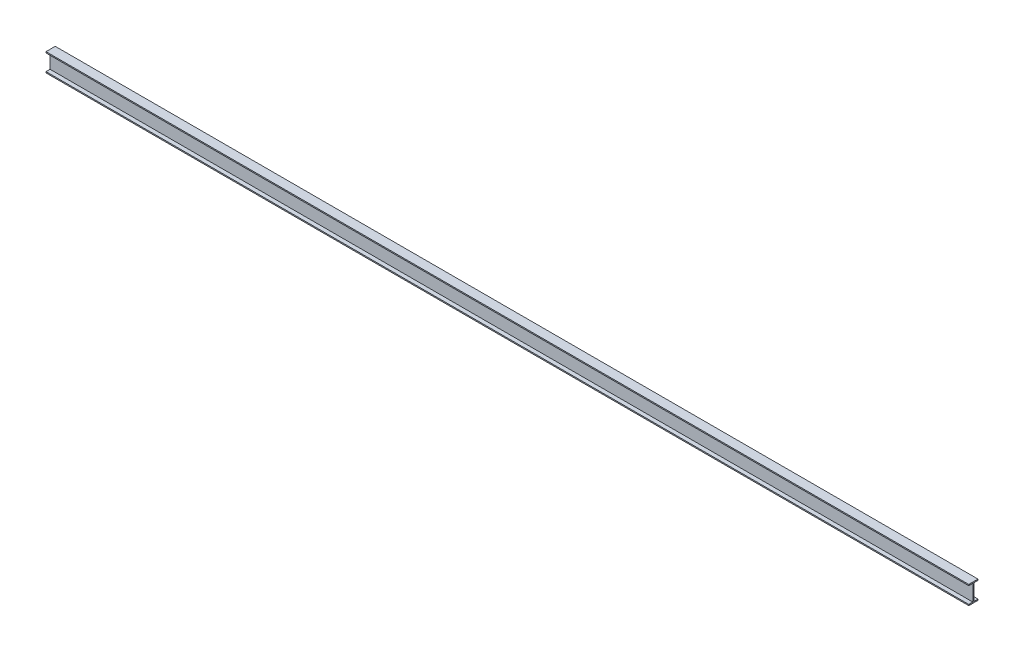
ISO-10303-21;
HEADER;
FILE_DESCRIPTION(('STEP AP214'),'2;1');
FILE_NAME('part.step','',(''),(''),'','','');
FILE_SCHEMA(('AUTOMOTIVE_DESIGN { 1 0 10303 214 1 1 1 1 }'));
ENDSEC;
DATA;
#1=APPLICATION_CONTEXT('core data for automotive mechanical design processes');
#2=APPLICATION_PROTOCOL_DEFINITION('international standard','automotive_design',2000,#1);
#3=PRODUCT_CONTEXT('',#1,'mechanical');
#4=PRODUCT('Part','Part','',(#3));
#5=PRODUCT_RELATED_PRODUCT_CATEGORY('part','',(#4));
#6=PRODUCT_DEFINITION_FORMATION('','',#4);
#7=PRODUCT_DEFINITION_CONTEXT('part definition',#1,'design');
#8=PRODUCT_DEFINITION('design','',#6,#7);
#9=PRODUCT_DEFINITION_SHAPE('','',#8);
#10=(LENGTH_UNIT() NAMED_UNIT(*) SI_UNIT(.MILLI.,.METRE.));
#11=(NAMED_UNIT(*) PLANE_ANGLE_UNIT() SI_UNIT($,.RADIAN.));
#12=(NAMED_UNIT(*) SI_UNIT($,.STERADIAN.) SOLID_ANGLE_UNIT());
#13=UNCERTAINTY_MEASURE_WITH_UNIT(LENGTH_MEASURE(1.E-05),#10,'distance_accuracy_value','');
#14=(GEOMETRIC_REPRESENTATION_CONTEXT(3) GLOBAL_UNCERTAINTY_ASSIGNED_CONTEXT((#13)) GLOBAL_UNIT_ASSIGNED_CONTEXT((#10,
#11,#12)) REPRESENTATION_CONTEXT('',''));
#15=CARTESIAN_POINT('',(0.,0.,0.));
#16=DIRECTION('',(0.,0.,1.));
#17=DIRECTION('',(1.,0.,0.));
#18=AXIS2_PLACEMENT_3D('',#15,#16,#17);
#19=CARTESIAN_POINT('',(8000.,10.,40.));
#20=DIRECTION('',(0.,0.,-1.));
#21=DIRECTION('',(0.,1.,0.));
#22=AXIS2_PLACEMENT_3D('',#19,#20,#21);
#23=PLANE('',#22);
#24=DIRECTION('',(0.,-1.,0.));
#25=VECTOR('',#24,1.);
#26=CARTESIAN_POINT('',(0.,10.,40.));
#27=LINE('',#26,#25);
#28=CARTESIAN_POINT('',(0.,10.,40.));
#29=VERTEX_POINT('',#28);
#30=CARTESIAN_POINT('',(0.,0.,40.));
#31=VERTEX_POINT('',#30);
#32=EDGE_CURVE('E151',#29,#31,#27,.T.);
#33=ORIENTED_EDGE('',*,*,#32,.T.);
#34=DIRECTION('',(-1.,0.,0.));
#35=VECTOR('',#34,1.);
#36=CARTESIAN_POINT('',(8000.,0.,40.));
#37=LINE('',#36,#35);
#38=CARTESIAN_POINT('',(8000.,0.,40.));
#39=VERTEX_POINT('',#38);
#40=EDGE_CURVE('E11',#39,#31,#37,.T.);
#41=ORIENTED_EDGE('',*,*,#40,.F.);
#42=DIRECTION('',(0.,-1.,0.));
#43=VECTOR('',#42,1.);
#44=CARTESIAN_POINT('',(8000.,10.,40.));
#45=LINE('',#44,#43);
#46=CARTESIAN_POINT('',(8000.,10.,40.));
#47=VERTEX_POINT('',#46);
#48=EDGE_CURVE('E173',#47,#39,#45,.T.);
#49=ORIENTED_EDGE('',*,*,#48,.F.);
#50=DIRECTION('',(-1.,0.,0.));
#51=VECTOR('',#50,1.);
#52=CARTESIAN_POINT('',(8000.,10.,40.));
#53=LINE('',#52,#51);
#54=EDGE_CURVE('E147',#47,#29,#53,.T.);
#55=ORIENTED_EDGE('',*,*,#54,.T.);
#56=EDGE_LOOP('',(#33,#41,#49,#55));
#57=FACE_BOUND('',#56,.T.);
#58=ADVANCED_FACE('F31',(#57),#23,.F.);
#59=CARTESIAN_POINT('',(8000.,0.,40.));
#60=DIRECTION('',(0.,1.,0.));
#61=DIRECTION('',(0.,0.,1.));
#62=AXIS2_PLACEMENT_3D('',#59,#60,#61);
#63=PLANE('',#62);
#64=DIRECTION('',(0.,0.,-1.));
#65=VECTOR('',#64,1.);
#66=CARTESIAN_POINT('',(0.,0.,40.));
#67=LINE('',#66,#65);
#68=CARTESIAN_POINT('',(0.,0.,-40.));
#69=VERTEX_POINT('',#68);
#70=EDGE_CURVE('E154',#31,#69,#67,.T.);
#71=ORIENTED_EDGE('',*,*,#70,.T.);
#72=DIRECTION('',(-1.,0.,0.));
#73=VECTOR('',#72,1.);
#74=CARTESIAN_POINT('',(8000.,0.,-40.));
#75=LINE('',#74,#73);
#76=CARTESIAN_POINT('',(8000.,0.,-40.));
#77=VERTEX_POINT('',#76);
#78=EDGE_CURVE('E39',#77,#69,#75,.T.);
#79=ORIENTED_EDGE('',*,*,#78,.F.);
#80=DIRECTION('',(0.,0.,-1.));
#81=VECTOR('',#80,1.);
#82=CARTESIAN_POINT('',(8000.,0.,40.));
#83=LINE('',#82,#81);
#84=EDGE_CURVE('E102',#39,#77,#83,.T.);
#85=ORIENTED_EDGE('',*,*,#84,.F.);
#86=ORIENTED_EDGE('',*,*,#40,.T.);
#87=EDGE_LOOP('',(#71,#79,#85,#86));
#88=FACE_BOUND('',#87,.T.);
#89=ADVANCED_FACE('F251',(#88),#63,.F.);
#90=CARTESIAN_POINT('',(8000.,0.,-40.));
#91=DIRECTION('',(0.,0.,1.));
#92=DIRECTION('',(0.,-1.,0.));
#93=AXIS2_PLACEMENT_3D('',#90,#91,#92);
#94=PLANE('',#93);
#95=DIRECTION('',(0.,1.,0.));
#96=VECTOR('',#95,1.);
#97=CARTESIAN_POINT('',(0.,0.,-40.));
#98=LINE('',#97,#96);
#99=CARTESIAN_POINT('',(0.,10.,-40.));
#100=VERTEX_POINT('',#99);
#101=EDGE_CURVE('E156',#69,#100,#98,.T.);
#102=ORIENTED_EDGE('',*,*,#101,.T.);
#103=DIRECTION('',(-1.,0.,0.));
#104=VECTOR('',#103,1.);
#105=CARTESIAN_POINT('',(8000.,10.,-40.));
#106=LINE('',#105,#104);
#107=CARTESIAN_POINT('',(8000.,10.,-40.));
#108=VERTEX_POINT('',#107);
#109=EDGE_CURVE('E192',#108,#100,#106,.T.);
#110=ORIENTED_EDGE('',*,*,#109,.F.);
#111=DIRECTION('',(0.,1.,0.));
#112=VECTOR('',#111,1.);
#113=CARTESIAN_POINT('',(8000.,0.,-40.));
#114=LINE('',#113,#112);
#115=EDGE_CURVE('E200',#77,#108,#114,.T.);
#116=ORIENTED_EDGE('',*,*,#115,.F.);
#117=ORIENTED_EDGE('',*,*,#78,.T.);
#118=EDGE_LOOP('',(#102,#110,#116,#117));
#119=FACE_BOUND('',#118,.T.);
#120=ADVANCED_FACE('F198',(#119),#94,.F.);
#121=CARTESIAN_POINT('',(8000.,10.,-40.));
#122=DIRECTION('',(0.,-1.,0.));
#123=DIRECTION('',(0.,0.,-1.));
#124=AXIS2_PLACEMENT_3D('',#121,#122,#123);
#125=PLANE('',#124);
#126=DIRECTION('',(0.,0.,1.));
#127=VECTOR('',#126,1.);
#128=CARTESIAN_POINT('',(0.,10.,-40.));
#129=LINE('',#128,#127);
#130=CARTESIAN_POINT('',(0.,10.,-5.));
#131=VERTEX_POINT('',#130);
#132=EDGE_CURVE('E158',#100,#131,#129,.T.);
#133=ORIENTED_EDGE('',*,*,#132,.T.);
#134=DIRECTION('',(-1.,0.,0.));
#135=VECTOR('',#134,1.);
#136=CARTESIAN_POINT('',(8000.,10.,-5.));
#137=LINE('',#136,#135);
#138=CARTESIAN_POINT('',(8000.,10.,-5.));
#139=VERTEX_POINT('',#138);
#140=EDGE_CURVE('E189',#139,#131,#137,.T.);
#141=ORIENTED_EDGE('',*,*,#140,.F.);
#142=DIRECTION('',(0.,0.,1.));
#143=VECTOR('',#142,1.);
#144=CARTESIAN_POINT('',(8000.,10.,-40.));
#145=LINE('',#144,#143);
#146=EDGE_CURVE('E218',#108,#139,#145,.T.);
#147=ORIENTED_EDGE('',*,*,#146,.F.);
#148=ORIENTED_EDGE('',*,*,#109,.T.);
#149=EDGE_LOOP('',(#133,#141,#147,#148));
#150=FACE_BOUND('',#149,.T.);
#151=ADVANCED_FACE('F209',(#150),#125,.F.);
#152=CARTESIAN_POINT('',(8000.,10.,-5.));
#153=DIRECTION('',(0.,0.,1.));
#154=DIRECTION('',(1.,0.,0.));
#155=AXIS2_PLACEMENT_3D('',#152,#153,#154);
#156=PLANE('',#155);
#157=DIRECTION('',(0.,1.,0.));
#158=VECTOR('',#157,1.);
#159=CARTESIAN_POINT('',(0.,10.,-5.));
#160=LINE('',#159,#158);
#161=CARTESIAN_POINT('',(0.,150.,-5.));
#162=VERTEX_POINT('',#161);
#163=EDGE_CURVE('E160',#131,#162,#160,.T.);
#164=ORIENTED_EDGE('',*,*,#163,.T.);
#165=DIRECTION('',(-1.,0.,0.));
#166=VECTOR('',#165,1.);
#167=CARTESIAN_POINT('',(8000.,150.,-5.));
#168=LINE('',#167,#166);
#169=CARTESIAN_POINT('',(8000.,150.,-5.));
#170=VERTEX_POINT('',#169);
#171=EDGE_CURVE('E186',#170,#162,#168,.T.);
#172=ORIENTED_EDGE('',*,*,#171,.F.);
#173=DIRECTION('',(0.,1.,0.));
#174=VECTOR('',#173,1.);
#175=CARTESIAN_POINT('',(8000.,10.,-5.));
#176=LINE('',#175,#174);
#177=EDGE_CURVE('E215',#139,#170,#176,.T.);
#178=ORIENTED_EDGE('',*,*,#177,.F.);
#179=ORIENTED_EDGE('',*,*,#140,.T.);
#180=EDGE_LOOP('',(#164,#172,#178,#179));
#181=FACE_BOUND('',#180,.T.);
#182=ADVANCED_FACE('F213',(#181),#156,.F.);
#183=CARTESIAN_POINT('',(8000.,150.,-5.));
#184=DIRECTION('',(0.,1.,0.));
#185=DIRECTION('',(0.,0.,1.));
#186=AXIS2_PLACEMENT_3D('',#183,#184,#185);
#187=PLANE('',#186);
#188=DIRECTION('',(0.,0.,-1.));
#189=VECTOR('',#188,1.);
#190=CARTESIAN_POINT('',(0.,150.,-5.));
#191=LINE('',#190,#189);
#192=CARTESIAN_POINT('',(0.,150.,-40.));
#193=VERTEX_POINT('',#192);
#194=EDGE_CURVE('E162',#162,#193,#191,.T.);
#195=ORIENTED_EDGE('',*,*,#194,.T.);
#196=DIRECTION('',(-1.,0.,0.));
#197=VECTOR('',#196,1.);
#198=CARTESIAN_POINT('',(8000.,150.,-40.));
#199=LINE('',#198,#197);
#200=CARTESIAN_POINT('',(8000.,150.,-40.));
#201=VERTEX_POINT('',#200);
#202=EDGE_CURVE('E183',#201,#193,#199,.T.);
#203=ORIENTED_EDGE('',*,*,#202,.F.);
#204=DIRECTION('',(0.,0.,-1.));
#205=VECTOR('',#204,1.);
#206=CARTESIAN_POINT('',(8000.,150.,-5.));
#207=LINE('',#206,#205);
#208=EDGE_CURVE('E217',#170,#201,#207,.T.);
#209=ORIENTED_EDGE('',*,*,#208,.F.);
#210=ORIENTED_EDGE('',*,*,#171,.T.);
#211=EDGE_LOOP('',(#195,#203,#209,#210));
#212=FACE_BOUND('',#211,.T.);
#213=ADVANCED_FACE('F264',(#212),#187,.F.);
#214=CARTESIAN_POINT('',(8000.,150.,-40.));
#215=DIRECTION('',(0.,0.,1.));
#216=DIRECTION('',(0.,-1.,0.));
#217=AXIS2_PLACEMENT_3D('',#214,#215,#216);
#218=PLANE('',#217);
#219=DIRECTION('',(0.,1.,0.));
#220=VECTOR('',#219,1.);
#221=CARTESIAN_POINT('',(0.,150.,-40.));
#222=LINE('',#221,#220);
#223=CARTESIAN_POINT('',(0.,160.,-40.));
#224=VERTEX_POINT('',#223);
#225=EDGE_CURVE('E164',#193,#224,#222,.T.);
#226=ORIENTED_EDGE('',*,*,#225,.T.);
#227=DIRECTION('',(-1.,0.,0.));
#228=VECTOR('',#227,1.);
#229=CARTESIAN_POINT('',(8000.,160.,-40.));
#230=LINE('',#229,#228);
#231=CARTESIAN_POINT('',(8000.,160.,-40.));
#232=VERTEX_POINT('',#231);
#233=EDGE_CURVE('E180',#232,#224,#230,.T.);
#234=ORIENTED_EDGE('',*,*,#233,.F.);
#235=DIRECTION('',(0.,1.,0.));
#236=VECTOR('',#235,1.);
#237=CARTESIAN_POINT('',(8000.,150.,-40.));
#238=LINE('',#237,#236);
#239=EDGE_CURVE('E220',#201,#232,#238,.T.);
#240=ORIENTED_EDGE('',*,*,#239,.F.);
#241=ORIENTED_EDGE('',*,*,#202,.T.);
#242=EDGE_LOOP('',(#226,#234,#240,#241));
#243=FACE_BOUND('',#242,.T.);
#244=ADVANCED_FACE('F267',(#243),#218,.F.);
#245=CARTESIAN_POINT('',(8000.,160.,-40.));
#246=DIRECTION('',(0.,-1.,0.));
#247=DIRECTION('',(0.,0.,-1.));
#248=AXIS2_PLACEMENT_3D('',#245,#246,#247);
#249=PLANE('',#248);
#250=DIRECTION('',(0.,0.,1.));
#251=VECTOR('',#250,1.);
#252=CARTESIAN_POINT('',(0.,160.,-40.));
#253=LINE('',#252,#251);
#254=CARTESIAN_POINT('',(0.,160.,40.));
#255=VERTEX_POINT('',#254);
#256=EDGE_CURVE('E166',#224,#255,#253,.T.);
#257=ORIENTED_EDGE('',*,*,#256,.T.);
#258=DIRECTION('',(-1.,0.,0.));
#259=VECTOR('',#258,1.);
#260=CARTESIAN_POINT('',(8000.,160.,40.));
#261=LINE('',#260,#259);
#262=CARTESIAN_POINT('',(8000.,160.,40.));
#263=VERTEX_POINT('',#262);
#264=EDGE_CURVE('E177',#263,#255,#261,.T.);
#265=ORIENTED_EDGE('',*,*,#264,.F.);
#266=DIRECTION('',(0.,0.,1.));
#267=VECTOR('',#266,1.);
#268=CARTESIAN_POINT('',(8000.,160.,-40.));
#269=LINE('',#268,#267);
#270=EDGE_CURVE('E226',#232,#263,#269,.T.);
#271=ORIENTED_EDGE('',*,*,#270,.F.);
#272=ORIENTED_EDGE('',*,*,#233,.T.);
#273=EDGE_LOOP('',(#257,#265,#271,#272));
#274=FACE_BOUND('',#273,.T.);
#275=ADVANCED_FACE('F232',(#274),#249,.F.);
#276=CARTESIAN_POINT('',(8000.,160.,40.));
#277=DIRECTION('',(0.,0.,-1.));
#278=DIRECTION('',(0.,1.,0.));
#279=AXIS2_PLACEMENT_3D('',#276,#277,#278);
#280=PLANE('',#279);
#281=DIRECTION('',(0.,-1.,0.));
#282=VECTOR('',#281,1.);
#283=CARTESIAN_POINT('',(0.,160.,40.));
#284=LINE('',#283,#282);
#285=CARTESIAN_POINT('',(0.,150.,40.));
#286=VERTEX_POINT('',#285);
#287=EDGE_CURVE('E168',#255,#286,#284,.T.);
#288=ORIENTED_EDGE('',*,*,#287,.T.);
#289=DIRECTION('',(-1.,0.,0.));
#290=VECTOR('',#289,1.);
#291=CARTESIAN_POINT('',(8000.,150.,40.));
#292=LINE('',#291,#290);
#293=CARTESIAN_POINT('',(8000.,150.,40.));
#294=VERTEX_POINT('',#293);
#295=EDGE_CURVE('E142',#294,#286,#292,.T.);
#296=ORIENTED_EDGE('',*,*,#295,.F.);
#297=DIRECTION('',(0.,-1.,0.));
#298=VECTOR('',#297,1.);
#299=CARTESIAN_POINT('',(8000.,160.,40.));
#300=LINE('',#299,#298);
#301=EDGE_CURVE('E133',#263,#294,#300,.T.);
#302=ORIENTED_EDGE('',*,*,#301,.F.);
#303=ORIENTED_EDGE('',*,*,#264,.T.);
#304=EDGE_LOOP('',(#288,#296,#302,#303));
#305=FACE_BOUND('',#304,.T.);
#306=ADVANCED_FACE('F236',(#305),#280,.F.);
#307=CARTESIAN_POINT('',(8000.,150.,40.));
#308=DIRECTION('',(0.,1.,0.));
#309=DIRECTION('',(0.,0.,1.));
#310=AXIS2_PLACEMENT_3D('',#307,#308,#309);
#311=PLANE('',#310);
#312=DIRECTION('',(0.,0.,-1.));
#313=VECTOR('',#312,1.);
#314=CARTESIAN_POINT('',(0.,150.,40.));
#315=LINE('',#314,#313);
#316=CARTESIAN_POINT('',(0.,150.,5.));
#317=VERTEX_POINT('',#316);
#318=EDGE_CURVE('E141',#286,#317,#315,.T.);
#319=ORIENTED_EDGE('',*,*,#318,.T.);
#320=DIRECTION('',(-1.,0.,0.));
#321=VECTOR('',#320,1.);
#322=CARTESIAN_POINT('',(8000.,150.,5.));
#323=LINE('',#322,#321);
#324=CARTESIAN_POINT('',(8000.,150.,5.));
#325=VERTEX_POINT('',#324);
#326=EDGE_CURVE('E138',#325,#317,#323,.T.);
#327=ORIENTED_EDGE('',*,*,#326,.F.);
#328=DIRECTION('',(0.,0.,-1.));
#329=VECTOR('',#328,1.);
#330=CARTESIAN_POINT('',(8000.,150.,40.));
#331=LINE('',#330,#329);
#332=EDGE_CURVE('E127',#294,#325,#331,.T.);
#333=ORIENTED_EDGE('',*,*,#332,.F.);
#334=ORIENTED_EDGE('',*,*,#295,.T.);
#335=EDGE_LOOP('',(#319,#327,#333,#334));
#336=FACE_BOUND('',#335,.T.);
#337=ADVANCED_FACE('F139',(#336),#311,.F.);
#338=CARTESIAN_POINT('',(8000.,150.,5.));
#339=DIRECTION('',(0.,0.,-1.));
#340=DIRECTION('',(-1.,0.,0.));
#341=AXIS2_PLACEMENT_3D('',#338,#339,#340);
#342=PLANE('',#341);
#343=DIRECTION('',(0.,-1.,0.));
#344=VECTOR('',#343,1.);
#345=CARTESIAN_POINT('',(0.,150.,5.));
#346=LINE('',#345,#344);
#347=CARTESIAN_POINT('',(0.,10.,5.));
#348=VERTEX_POINT('',#347);
#349=EDGE_CURVE('E88',#317,#348,#346,.T.);
#350=ORIENTED_EDGE('',*,*,#349,.T.);
#351=DIRECTION('',(-1.,0.,0.));
#352=VECTOR('',#351,1.);
#353=CARTESIAN_POINT('',(8000.,10.,5.));
#354=LINE('',#353,#352);
#355=CARTESIAN_POINT('',(8000.,10.,5.));
#356=VERTEX_POINT('',#355);
#357=EDGE_CURVE('E143',#356,#348,#354,.T.);
#358=ORIENTED_EDGE('',*,*,#357,.F.);
#359=DIRECTION('',(0.,-1.,0.));
#360=VECTOR('',#359,1.);
#361=CARTESIAN_POINT('',(8000.,150.,5.));
#362=LINE('',#361,#360);
#363=EDGE_CURVE('E131',#325,#356,#362,.T.);
#364=ORIENTED_EDGE('',*,*,#363,.F.);
#365=ORIENTED_EDGE('',*,*,#326,.T.);
#366=EDGE_LOOP('',(#350,#358,#364,#365));
#367=FACE_BOUND('',#366,.T.);
#368=ADVANCED_FACE('F145',(#367),#342,.F.);
#369=CARTESIAN_POINT('',(8000.,10.,5.));
#370=DIRECTION('',(0.,-1.,0.));
#371=DIRECTION('',(0.,0.,-1.));
#372=AXIS2_PLACEMENT_3D('',#369,#370,#371);
#373=PLANE('',#372);
#374=DIRECTION('',(0.,0.,1.));
#375=VECTOR('',#374,1.);
#376=CARTESIAN_POINT('',(0.,10.,5.));
#377=LINE('',#376,#375);
#378=EDGE_CURVE('E94',#348,#29,#377,.T.);
#379=ORIENTED_EDGE('',*,*,#378,.T.);
#380=ORIENTED_EDGE('',*,*,#54,.F.);
#381=DIRECTION('',(0.,0.,1.));
#382=VECTOR('',#381,1.);
#383=CARTESIAN_POINT('',(8000.,10.,5.));
#384=LINE('',#383,#382);
#385=EDGE_CURVE('E47',#356,#47,#384,.T.);
#386=ORIENTED_EDGE('',*,*,#385,.F.);
#387=ORIENTED_EDGE('',*,*,#357,.T.);
#388=EDGE_LOOP('',(#379,#380,#386,#387));
#389=FACE_BOUND('',#388,.T.);
#390=ADVANCED_FACE('F240',(#389),#373,.F.);
#391=CARTESIAN_POINT('',(8000.,0.,40.));
#392=DIRECTION('',(1.,0.,0.));
#393=DIRECTION('',(0.,0.,-1.));
#394=AXIS2_PLACEMENT_3D('',#391,#392,#393);
#395=PLANE('',#394);
#396=ORIENTED_EDGE('',*,*,#48,.T.);
#397=ORIENTED_EDGE('',*,*,#84,.T.);
#398=ORIENTED_EDGE('',*,*,#115,.T.);
#399=ORIENTED_EDGE('',*,*,#146,.T.);
#400=ORIENTED_EDGE('',*,*,#177,.T.);
#401=ORIENTED_EDGE('',*,*,#208,.T.);
#402=ORIENTED_EDGE('',*,*,#239,.T.);
#403=ORIENTED_EDGE('',*,*,#270,.T.);
#404=ORIENTED_EDGE('',*,*,#301,.T.);
#405=ORIENTED_EDGE('',*,*,#332,.T.);
#406=ORIENTED_EDGE('',*,*,#363,.T.);
#407=ORIENTED_EDGE('',*,*,#385,.T.);
#408=EDGE_LOOP('',(#396,#397,#398,#399,#400,#401,#402,#403,#404,#405,#406,#407));
#409=FACE_BOUND('',#408,.T.);
#410=ADVANCED_FACE('F129',(#409),#395,.T.);
#411=CARTESIAN_POINT('',(0.,0.,40.));
#412=DIRECTION('',(1.,0.,0.));
#413=DIRECTION('',(0.,0.,-1.));
#414=AXIS2_PLACEMENT_3D('',#411,#412,#413);
#415=PLANE('',#414);
#416=ORIENTED_EDGE('',*,*,#32,.F.);
#417=ORIENTED_EDGE('',*,*,#378,.F.);
#418=ORIENTED_EDGE('',*,*,#349,.F.);
#419=ORIENTED_EDGE('',*,*,#318,.F.);
#420=ORIENTED_EDGE('',*,*,#287,.F.);
#421=ORIENTED_EDGE('',*,*,#256,.F.);
#422=ORIENTED_EDGE('',*,*,#225,.F.);
#423=ORIENTED_EDGE('',*,*,#194,.F.);
#424=ORIENTED_EDGE('',*,*,#163,.F.);
#425=ORIENTED_EDGE('',*,*,#132,.F.);
#426=ORIENTED_EDGE('',*,*,#101,.F.);
#427=ORIENTED_EDGE('',*,*,#70,.F.);
#428=EDGE_LOOP('',(#416,#417,#418,#419,#420,#421,#422,#423,#424,#425,#426,#427));
#429=FACE_BOUND('',#428,.T.);
#430=ADVANCED_FACE('F204',(#429),#415,.F.);
#431=CLOSED_SHELL('',(#58,#89,#120,#151,#182,#213,#244,#275,#306,#337,#368,#390,#410,#430));
#432=MANIFOLD_SOLID_BREP('B2',#431);
#433=ADVANCED_BREP_SHAPE_REPRESENTATION('',(#18,#432),#14);
#434=SHAPE_DEFINITION_REPRESENTATION(#9,#433);
ENDSEC;
END-ISO-10303-21;
